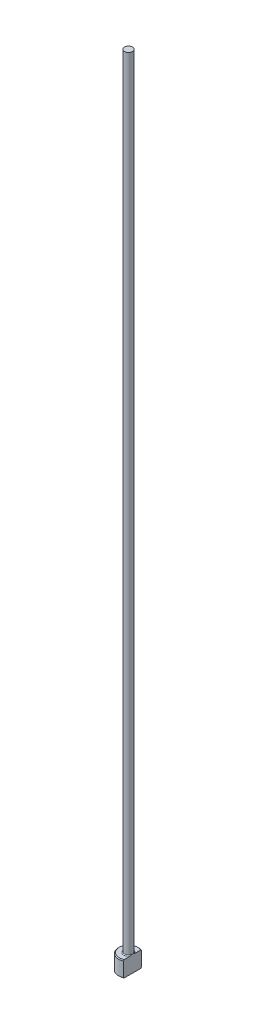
from build123d import *
from build123d.topology import SkipClean

# Parameters (mm, degrees)
CHAMFER1_SIZE    = 0.2
FILLET1_R        = 0.2
KEYED_HEAD_DEPTH = 201.031247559


with BuildPart() as part:
    # Sketch1 → Revolve1 (revolve)
    with BuildSketch(Plane.XY, mode=Mode.PRIVATE) as revolve1_sk:
        Polygon((0, 0), (-2.5, 0), (-2.5, 4), (-1, 4), (-1, 200), (0, 200), align=None)
    revolve(revolve1_sk.sketch.rotate(Axis((0, 259.958771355, 0), (0, -1, 0)), 270), axis=Axis((0, 259.958771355, 0), (0, -1, 0)))

    # Chamfer1
    chamfer1_edges = [part.edges().sort_by_distance(p)[0] for p in [
        (0, 4, -2.5),
        (0, 0, -2.5),
    ]]
    chamfer(chamfer1_edges, length=CHAMFER1_SIZE)

    # Fillet1
    fillet1_edges = [part.edges().sort_by_distance(p)[0] for p in [
        (0, 4, -1),
    ]]
    fillet(fillet1_edges, radius=FILLET1_R)

    # Sketch2 → KEYED HEAD (cut, through all)
    with SkipClean():  # the faces are left unmerged after this step: merging them gives an invalid solid
        with BuildSketch(Plane(origin=(0, 0, 0), x_dir=(1, 0, 0), z_dir=(0, 1, 0))):
            with BuildLine():
                Line((1, -2.291287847), (1, 2.291287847))
                ThreePointArc((1, 2.291287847), (2.5, 0), (1, -2.291287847))
            make_face()
        extrude(amount=KEYED_HEAD_DEPTH, mode=Mode.SUBTRACT)


solid = part.part
